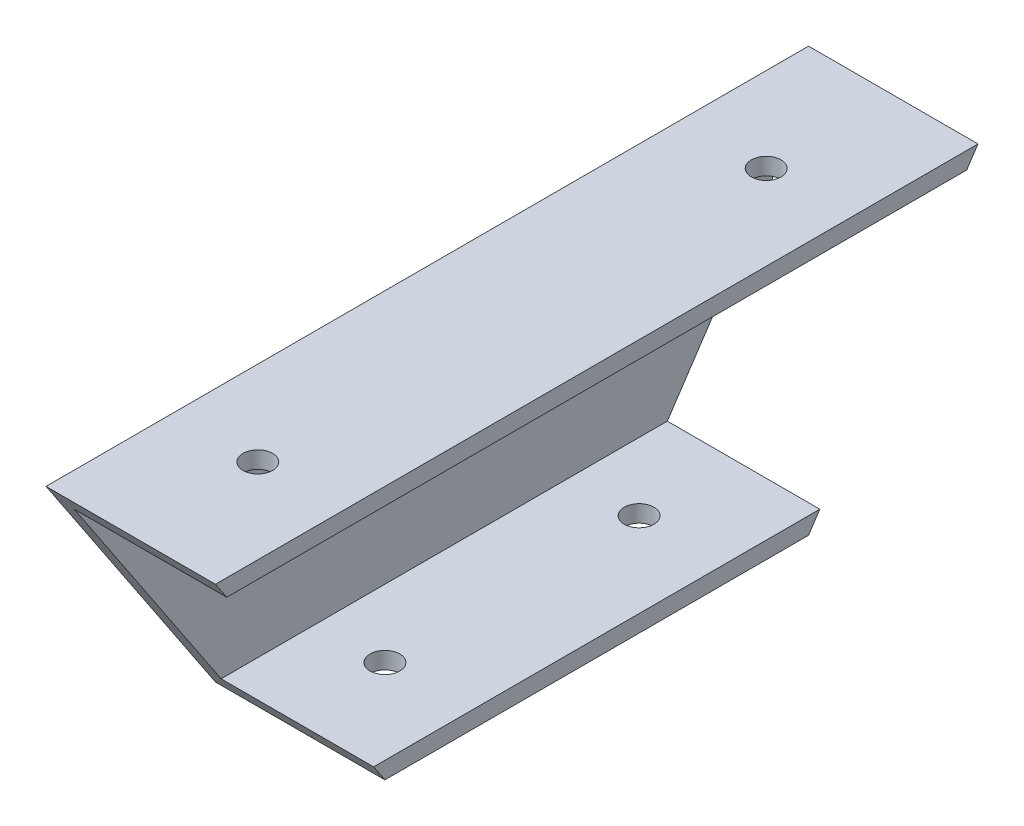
from build123d import *

# Parameters (mm, degrees)
EXTRUDE1_DEPTH = 90
EXTRUDE2_DEPTH = 45
SKETCH4_R      = 1.75
EXTRUDE3_DEPTH = 10
SKETCH5_R      = 1.75
EXTRUDE4_DEPTH = 10


with BuildPart() as part:
    # Sketch1 → Extrude1 (new body)
    with BuildSketch(Plane.XY):
        Polygon((0, 0), (20, 0), (20, 2), (2, 2), (2, 28), (20, 28), (20, 30), (0, 30), align=None)
    extrude(amount=EXTRUDE1_DEPTH)

    # Sketch3 → Extrude2 (cut, symmetric)
    with BuildSketch(Plane(origin=(2, 0, 0), x_dir=(0, 0, -1), z_dir=(1, 0, 0))):
        Polygon((-20, 0), (0, 30), (0, 0), align=None)
        Polygon((-70, 0), (-90, 30), (-90, 0), align=None)
    extrude(amount=EXTRUDE2_DEPTH, both=True, mode=Mode.SUBTRACT)

    # Sketch4 → Extrude3 (cut)
    with BuildSketch(Plane.XZ):
        with Locations(Location((10, 30, 0), (0, 0, 270))):
            Circle(SKETCH4_R)
        with Locations(Location((10, 60, 0), (0, 0, 270))):
            Circle(SKETCH4_R)
    extrude(amount=-EXTRUDE3_DEPTH, mode=Mode.SUBTRACT)

    # Sketch5 → Extrude4 (cut)
    with BuildSketch(Plane.XZ.offset(-28)):
        with Locations((10, 15)):
            Circle(SKETCH5_R)
        with Locations((10, 75)):
            Circle(SKETCH5_R)
    extrude(amount=-EXTRUDE4_DEPTH, mode=Mode.SUBTRACT)


solid = part.part
